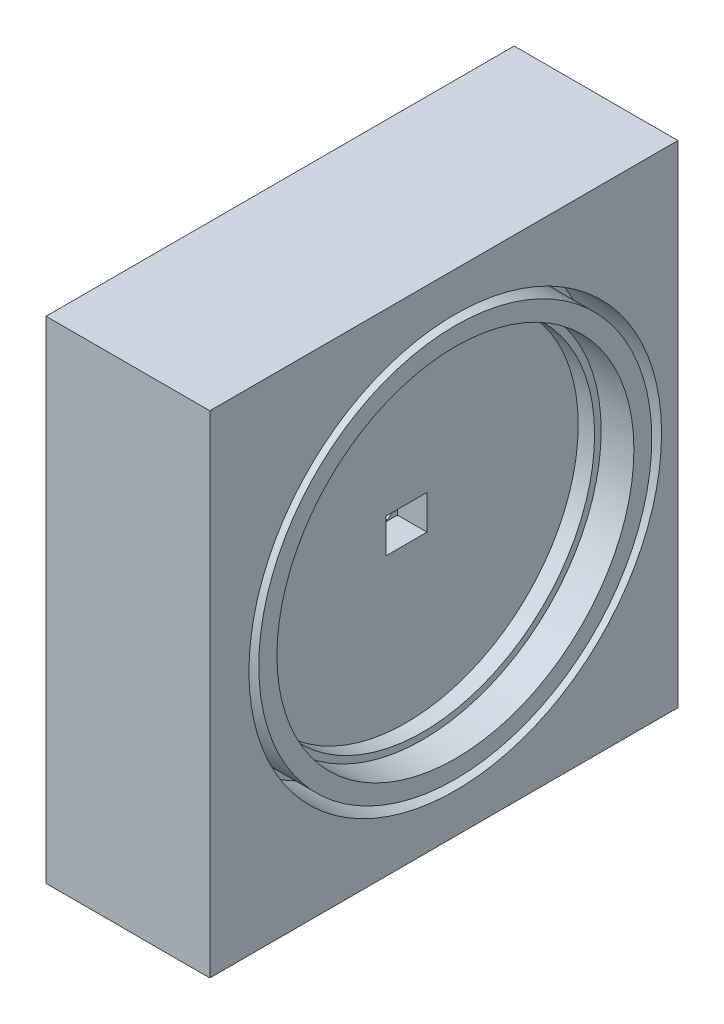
from build123d import *

# Parameters (mm, degrees)
SKETCH1_W                = 50
SKETCH1_H                = 150
BOSS_EXTRUDE1_DEPTH      = 250
SKETCH2_R                = 52.5
CUT_EXTRUDE1_DEPTH       = 15
BOSS_EXTRUDE2_DEPTH      = 150
BOSS_EXTRUDE3_DEPTH      = 175
SKETCH10_W               = 49.988184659
SKETCH10_H               = 250
BOSS_EXTRUDE4_DEPTH      = 200
CUT_EXTRUDE4_DEPTH       = 471.132959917
SKETCH12_W               = 200
SKETCH12_H               = 49.988184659
CUT_EXTRUDE5_DEPTH       = 55
CUT_EXTRUDE8_DEPTH       = 20
SKETCH17_W               = 12.5
SKETCH17_H               = 10.5
CUT_EXTRUDE9_DEPTH       = 9
SKETCH20_R               = 54.5
CUT_EXTRUDE10_DEPTH      = 10
SKETCH21_W               = 182.056865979
SKETCH21_H               = 55
CUT_EXTRUDE11_DEPTH      = 457.207189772
SKETCH24_W               = 16.5
SKETCH24_H               = 16.5
CUT_EXTRUDE13_DEPTH      = 50
SKETCH25_W               = 16.5
SKETCH25_H               = 22
CUT_EXTRUDE14_DEPTH      = 50
SKETCH26_W               = 16.5
SKETCH26_H               = 6.313729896
CUT_EXTRUDE15_DEPTH      = 50
CUT_EXTRUDE16_START      = -71.75
CUT_EXTRUDE16_DEPTH      = 29
SKETCH29_W               = 12.5
SKETCH29_H               = 10.5
CUT_EXTRUDE18_DEPTH      = 9
SKETCH30_W               = 40.672773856
SKETCH30_H               = 32.854304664
CUT_EXTRUDE19_DEPTH      = 50
SKETCH31_R               = 3.5
CUT_EXTRUDE20_DEPTH      = 20
CUT_EXTRUDE21_DEPTH      = 33
SKETCH33_R               = 63
SKETCH33_R_2             = 60
CUT_EXTRUDE22_DEPTH      = 20
SKETCH34_W               = 321
SKETCH34_H               = 90
CUT_EXTRUDE23_DEPTH      = 300
CUT_EXTRUDE24_DEPTH      = 358.678093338
CUT_EXTRUDE24_DEPTH_BACK = 358.678093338
SKETCH35_W               = 71
SKETCH35_H               = 235
SKETCH35_W_2             = 71.037708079
BOSS_EXTRUDE5_START      = -155
SKETCH36_W               = 50
SKETCH36_H               = 45
BOSS_EXTRUDE5_DEPTH      = 40
SKETCH38_W               = 110
SKETCH38_H               = 15
BOSS_EXTRUDE6_DEPTH      = 40
SKETCH39_W               = 110
SKETCH39_H               = 15
BOSS_EXTRUDE7_DEPTH      = 40
CUT_EXTRUDE25_DEPTH      = 342.833292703
CUT_EXTRUDE25_DEPTH_BACK = 342.833292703
SKETCH40_R               = 5
SKETCH41_W               = 20.15
SKETCH41_H               = 20.15
CUT_EXTRUDE26_DEPTH      = 31.5
CUT_EXTRUDE27_DEPTH      = 99
CUT_EXTRUDE27_DEPTH_BACK = 50
SKETCH42_W               = 92.056865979
SKETCH42_H               = 195
CUT_EXTRUDE29_DEPTH      = 50
CUT_EXTRUDE29_DEPTH_BACK = 121
SKETCH47_W               = 142.943134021
SKETCH47_H               = 100
SKETCH48_W               = 25
SKETCH48_H               = 25
CUT_EXTRUDE30_DEPTH      = 10
SKETCH49_W               = 25
SKETCH49_H               = 25
CUT_EXTRUDE31_DEPTH      = 10


with BuildPart() as part:
    # Sketch1 → Boss-Extrude1 (new body)
    with BuildSketch(Plane(origin=(0, 0, 0), x_dir=(1, 0, 0), z_dir=(0, 1, 0))):
        with Locations((5, 75)):
            Rectangle(SKETCH1_W, SKETCH1_H)
    extrude(amount=BOSS_EXTRUDE1_DEPTH)

    # Sketch2 → Cut-Extrude1 (cut)
    with BuildSketch(Plane(origin=(30, 0, 0), x_dir=(0, 0, -1), z_dir=(1, 0, 0))):
        with Locations((75, 175)):
            Circle(SKETCH2_R)
    extrude(amount=-CUT_EXTRUDE1_DEPTH, mode=Mode.SUBTRACT)

    # Sketch4 → Boss-Extrude2 (add)
    with BuildSketch(Plane.XY):
        with BuildLine():
            Line((30, 0), (30, 62.5))
            ThreePointArc((30, 62.5), (53.728602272, 17.849160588), (101.037708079, 0))
            Line((101.037708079, 0), (30, 0))
        make_face()
        with BuildLine():
            Line((-20, 0), (-91, 0))
            ThreePointArc((-91, 0), (-43.705047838, 17.850934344), (-20, 62.5))
            Line((-20, 62.5), (-20, 0))
        make_face()
    extrude(amount=-BOSS_EXTRUDE2_DEPTH)

    # Sketch8 → Boss-Extrude3 (add)
    with BuildSketch(Plane(origin=(0, 0, -150), x_dir=(-1, 0, 0), z_dir=(0, 0, -1))):
        with BuildLine():
            Line((-30, 250), (-30, 62.5))
            ThreePointArc((-30, 62.5), (-53.728602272, 17.849160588), (-101.037708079, 0))
            Line((-101.037708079, 0), (91, 0))
            ThreePointArc((91, 0), (43.705047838, 17.850934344), (20, 62.5))
            Line((20, 62.5), (20, 250))
            Line((20, 250), (-30, 250))
        make_face()
    extrude(amount=BOSS_EXTRUDE3_DEPTH)

    # Sketch10 → Boss-Extrude4 (add)
    with BuildSketch(Plane(origin=(30, 0, 0), x_dir=(0, 0, -1), z_dir=(1, 0, 0))):
        with Locations((300.005907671, 125)):
            Rectangle(SKETCH10_W, SKETCH10_H)
    extrude(amount=BOSS_EXTRUDE4_DEPTH)

    # Sketch11 → Cut-Extrude4 (cut, through all)
    with BuildSketch(Plane(origin=(0, 0, -325), x_dir=(-1, 0, 0), z_dir=(0, 0, -1))):
        Polygon((-166.5, 175), (-135.5, 175), (-135.5, 154), (-197.5, 154), (-197.5, 175), align=None)
    extrude(amount=-CUT_EXTRUDE4_DEPTH, mode=Mode.SUBTRACT)

    # Sketch12 → Cut-Extrude5 (cut)
    with BuildSketch(Plane(origin=(0, 250, 0), x_dir=(1, 0, 0), z_dir=(0, 1, 0))):
        with Locations((130, 300.005907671)):
            Rectangle(SKETCH12_W, SKETCH12_H)
    extrude(amount=-CUT_EXTRUDE5_DEPTH, mode=Mode.SUBTRACT)

    # Sketch16 → Cut-Extrude8 (cut)
    with BuildSketch(Plane(origin=(15, 0, 0), x_dir=(0, 0, -1), z_dir=(1, 0, 0))):
        with BuildLine():
            Line((71.75, 180), (78.25, 180))
            add(Edge.make_bspline(
                [(78.25, 170), (84.285140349, 175), (78.25, 180)],
                knots=[0, 0, 0, 1, 1, 1], degree=2))
            Line((78.25, 170), (71.75, 170))
            add(Edge.make_bspline(
                [(71.75, 180), (66.057994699, 175), (71.75, 170)],
                knots=[0, 0, 0, 1, 1, 1], degree=2))
        make_face()
    extrude(amount=-CUT_EXTRUDE8_DEPTH, mode=Mode.SUBTRACT)

    # Sketch17 → Cut-Extrude9 (cut)
    with BuildSketch(Plane(origin=(15, 0, 0), x_dir=(0, 0, -1), z_dir=(1, 0, 0))):
        with Locations((75.068297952, 175)):
            Rectangle(SKETCH17_W, SKETCH17_H)
    extrude(amount=-CUT_EXTRUDE9_DEPTH, mode=Mode.SUBTRACT)

    # Sketch20 → Cut-Extrude10 (cut)
    with BuildSketch(Plane(origin=(30, 0, 0), x_dir=(0, 0, -1), z_dir=(1, 0, 0))):
        with Locations((75, 175)):
            Circle(SKETCH20_R)
    extrude(amount=-CUT_EXTRUDE10_DEPTH, mode=Mode.SUBTRACT)

    # Sketch21 → Cut-Extrude11 (cut, through all)
    with BuildSketch(Plane(origin=(30, 0, 0), x_dir=(0, 0, -1), z_dir=(1, 0, 0))):
        with Locations((233.97156701, 222.5)):
            Rectangle(SKETCH21_W, SKETCH21_H)
    extrude(amount=-CUT_EXTRUDE11_DEPTH, mode=Mode.SUBTRACT)

    # Sketch24 → Cut-Extrude13 (cut)
    with BuildSketch(Plane.XY.offset(-275.011815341)):
        with Locations((166.5, 145.75)):
            Rectangle(SKETCH24_W, SKETCH24_H)
    extrude(amount=-CUT_EXTRUDE13_DEPTH, mode=Mode.SUBTRACT)

    # Sketch25 → Cut-Extrude14 (cut)
    with BuildSketch(Plane.XY.offset(-275.011815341)):
        with Locations((166.5, 120.186270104)):
            Rectangle(SKETCH25_W, SKETCH25_H)
    extrude(amount=-CUT_EXTRUDE14_DEPTH, mode=Mode.SUBTRACT)

    # Sketch26 → Cut-Extrude15 (cut)
    with BuildSketch(Plane.XY.offset(-275.011815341)):
        with Locations((166.5, 134.343135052)):
            Rectangle(SKETCH26_W, SKETCH26_H)
    extrude(amount=-CUT_EXTRUDE15_DEPTH, mode=Mode.SUBTRACT)

    # Sketch27 → Cut-Extrude16 (cut)
    with BuildSketch(Plane(origin=(230, 0, 0), x_dir=(0, 0, -1), z_dir=(1, 0, 0)).offset(CUT_EXTRUDE16_START)):
        with BuildLine():
            Line((291.501152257, 135.100374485), (298.001152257, 135.100374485))
            add(Edge.make_bspline(
                [(298.001152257, 125.100374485), (303.344461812, 130.207776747), (298.001152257, 135.100374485)],
                knots=[0, 0, 0, 1, 1, 1], degree=2))
            Line((298.001152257, 125.100374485), (291.501152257, 125.100374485))
            add(Edge.make_bspline(
                [(291.501152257, 135.100374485), (285.456075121, 130.207776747), (291.501152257, 125.100374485)],
                knots=[0, 0, 0, 1, 1, 1], degree=2))
        make_face()
    extrude(amount=-CUT_EXTRUDE16_DEPTH, mode=Mode.SUBTRACT)

    # Sketch29 → Cut-Extrude18 (cut)
    with BuildSketch(Plane(origin=(158.25, 0, 0), x_dir=(0, 0, -1), z_dir=(1, 0, 0))):
        with Locations((294.582313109, 130.149892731)):
            Rectangle(SKETCH29_W, SKETCH29_H)
        with BuildLine():
            Line((298.001152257, 135.100374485), (291.501152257, 135.100374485))
            add(Edge.make_bspline(
                [(291.501152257, 135.100374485), (285.456075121, 130.207776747), (291.501152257, 125.100374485)],
                knots=[0, 0, 0, 1, 1, 1], degree=2))
            Line((291.501152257, 125.100374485), (298.001152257, 125.100374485))
            add(Edge.make_bspline(
                [(298.001152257, 125.100374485), (303.344461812, 130.207776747), (298.001152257, 135.100374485)],
                knots=[0, 0, 0, 1, 1, 1], degree=2))
        make_face(mode=Mode.SUBTRACT)
    extrude(amount=-CUT_EXTRUDE18_DEPTH, mode=Mode.SUBTRACT)

    # Sketch30 → Cut-Extrude19 (cut)
    with BuildSketch(Plane.XY.offset(-275.011815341)):
        with Locations((178.586386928, 125.602490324)):
            Rectangle(SKETCH30_W, SKETCH30_H)
    extrude(amount=-CUT_EXTRUDE19_DEPTH, mode=Mode.SUBTRACT)

    # Sketch31 → Cut-Extrude20 (cut)
    with BuildSketch(Plane(origin=(-5, 0, 0), x_dir=(0, 0, -1), z_dir=(1, 0, 0))):
        with Locations((74.950457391, 175.071160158)):
            Circle(SKETCH31_R)
    extrude(amount=-CUT_EXTRUDE20_DEPTH, mode=Mode.SUBTRACT)

    # Sketch32 → Cut-Extrude21 (cut)
    with BuildSketch(Plane(origin=(0, 0, -325), x_dir=(-1, 0, 0), z_dir=(0, 0, -1))):
        with BuildLine():
            ThreePointArc((-128.116356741, 129.990231), (-128.41227742, 131.398732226), (-129.25, 132.569059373))
            Line((-129.25, 132.569059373), (-129.25, 127.411402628))
            ThreePointArc((-129.25, 127.411402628), (-128.41227742, 128.581729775), (-128.116356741, 129.990231))
        make_face()
        with BuildLine():
            Line((-129.25, 127.411402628), (-129.25, 132.569059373))
            ThreePointArc((-129.25, 132.569059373), (-135.116356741, 129.990231), (-129.25, 127.411402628))
        make_face()
    extrude(amount=-CUT_EXTRUDE21_DEPTH, mode=Mode.SUBTRACT)

    # Sketch33 → Cut-Extrude22 (cut)
    with BuildSketch(Plane(origin=(30, 0, 0), x_dir=(0, 0, -1), z_dir=(1, 0, 0))):
        with Locations((74.950457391, 175.071160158)):
            Circle(SKETCH33_R)
        with Locations((74.950457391, 175.071160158)):
            Circle(SKETCH33_R_2, mode=Mode.SUBTRACT)
    extrude(amount=-CUT_EXTRUDE22_DEPTH, mode=Mode.SUBTRACT)

    # Sketch34 → Cut-Extrude23 (cut)
    with BuildSketch(Plane(origin=(0, 195, 0), x_dir=(1, 0, 0), z_dir=(0, 1, 0))):
        with Locations((69.5, 280)):
            Rectangle(SKETCH34_W, SKETCH34_H)
    extrude(amount=-CUT_EXTRUDE23_DEPTH, mode=Mode.SUBTRACT)

    # Sketch35 → Cut-Extrude24 (cut, two sides: drawn at the far end of the back side and taken through both)
    with BuildSketch(Plane(origin=(0, 250, 0), x_dir=(1, 0, 0), z_dir=(0, 1, 0)).offset(-CUT_EXTRUDE24_DEPTH_BACK)):
        with Locations((-55.5, 117.5)):
            Rectangle(SKETCH35_W, SKETCH35_H)
        with Locations((65.51885404, 117.5)):
            Rectangle(SKETCH35_W_2, SKETCH35_H)
    extrude(amount=CUT_EXTRUDE24_DEPTH + CUT_EXTRUDE24_DEPTH_BACK, mode=Mode.SUBTRACT)

    # Sketch36 → Boss-Extrude5 (add)
    with BuildSketch(Plane(origin=(0, 195, 0), x_dir=(1, 0, 0), z_dir=(0, 1, 0)).offset(BOSS_EXTRUDE5_START)):
        with Locations((55, 212.5)):
            Rectangle(SKETCH36_W, SKETCH36_H)
    extrude(amount=-BOSS_EXTRUDE5_DEPTH)

    # Sketch38 → Boss-Extrude6 (add)
    with BuildSketch(Plane(origin=(30, 0, 0), x_dir=(0, 0, -1), z_dir=(1, 0, 0))):
        with Locations((55, 7.5)):
            Rectangle(SKETCH38_W, SKETCH38_H)
    extrude(amount=BOSS_EXTRUDE6_DEPTH)

    # Sketch39 → Boss-Extrude7 (add)
    with BuildSketch(Plane.ZY.offset(20)):
        with Locations((-55, 7.5)):
            Rectangle(SKETCH39_W, SKETCH39_H)
    extrude(amount=BOSS_EXTRUDE7_DEPTH)

    # Sketch40 → Cut-Extrude25 (cut, two sides: drawn at the far end of the back side and taken through both)
    with BuildSketch(Plane(origin=(0, 15, 0), x_dir=(1, 0, 0), z_dir=(0, 1, 0)).offset(-CUT_EXTRUDE25_DEPTH_BACK)):
        with Locations(Location((-40, 85, 0), (0, 0, 270))):
            Circle(SKETCH40_R)
        with Locations(Location((-40, 25, 0), (0, 0, 270))):
            Circle(SKETCH40_R)
        with Locations(Location((50, 85, 0), (0, 0, 270))):
            Circle(SKETCH40_R)
        with Locations(Location((50, 25, 0), (0, 0, 270))):
            Circle(SKETCH40_R)
    extrude(amount=CUT_EXTRUDE25_DEPTH + CUT_EXTRUDE25_DEPTH_BACK, mode=Mode.SUBTRACT)

    # Sketch41 → Cut-Extrude26 (cut)
    with BuildSketch(Plane(origin=(0, 0, -235), x_dir=(-1, 0, 0), z_dir=(0, 0, -1))):
        with Locations((-5, 152)):
            Rectangle(SKETCH41_W, SKETCH41_H)
        with Locations((-5, 99)):
            Rectangle(SKETCH41_W, SKETCH41_H)
        with Locations((-5, 46)):
            Rectangle(SKETCH41_W, SKETCH41_H)
        with Locations((-52, 20)):
            Rectangle(SKETCH41_W, SKETCH41_H)
    extrude(amount=-CUT_EXTRUDE26_DEPTH, mode=Mode.SUBTRACT)

    # Sketch42 → Cut-Extrude27 (cut, two sides: drawn at the far end of the back side and taken through both)
    with BuildSketch(Plane(origin=(0, 0, 0), x_dir=(0, 0, -1), z_dir=(1, 0, 0)).offset(-CUT_EXTRUDE27_DEPTH_BACK)):
        with Locations((188.971567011, 97.5)):
            Rectangle(SKETCH42_W, SKETCH42_H)
    extrude(amount=CUT_EXTRUDE27_DEPTH + CUT_EXTRUDE27_DEPTH_BACK, mode=Mode.SUBTRACT)

    # Sketch47 → Cut-Extrude29 (cut, two sides: drawn at the far end of the back side and taken through both)
    with BuildSketch(Plane(origin=(30, 0, 0), x_dir=(0, 0, -1), z_dir=(1, 0, 0)).offset(-CUT_EXTRUDE29_DEPTH_BACK)):
        with Locations((71.471567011, 50)):
            Rectangle(SKETCH47_W, SKETCH47_H)
    extrude(amount=CUT_EXTRUDE29_DEPTH + CUT_EXTRUDE29_DEPTH_BACK, mode=Mode.SUBTRACT)

    # Sketch48 → Cut-Extrude30 (cut)
    with BuildSketch(Plane.XZ.offset(-100)):
        with Locations((5, -71.47156701)):
            Rectangle(SKETCH48_W, SKETCH48_H)
    extrude(amount=-CUT_EXTRUDE30_DEPTH, mode=Mode.SUBTRACT)

    # Sketch49 → Cut-Extrude31 (cut)
    with BuildSketch(Plane(origin=(0, 0, -142.943134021), x_dir=(-1, 0, 0), z_dir=(0, 0, -1))):
        with Locations((-5, 175)):
            Rectangle(SKETCH49_W, SKETCH49_H)
    extrude(amount=-CUT_EXTRUDE31_DEPTH, mode=Mode.SUBTRACT)


solid = part.part
